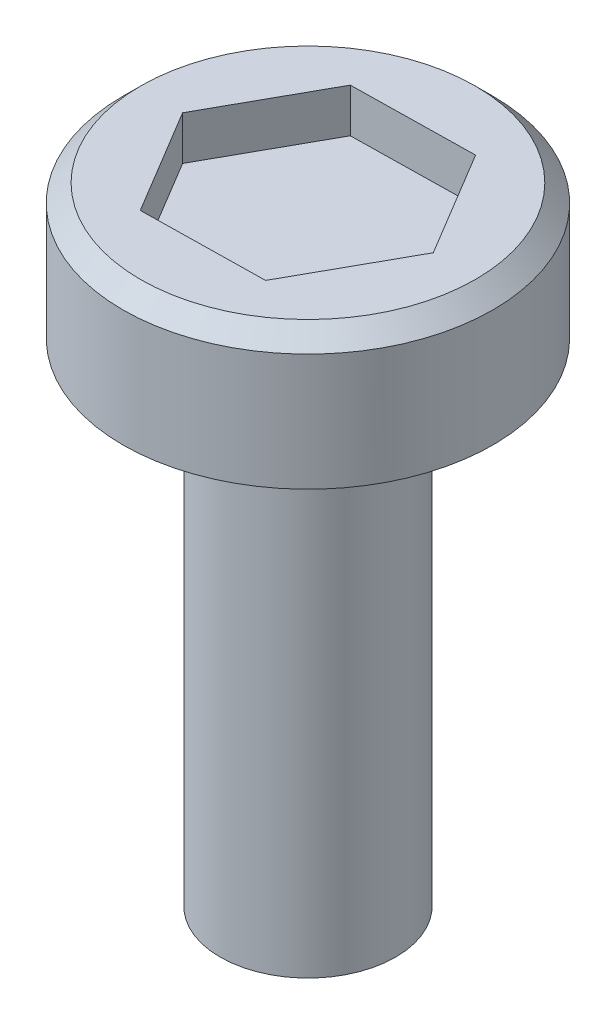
ISO-10303-21;
HEADER;
FILE_DESCRIPTION(('STEP AP214'),'2;1');
FILE_NAME('part.step','',(''),(''),'','','');
FILE_SCHEMA(('AUTOMOTIVE_DESIGN { 1 0 10303 214 1 1 1 1 }'));
ENDSEC;
DATA;
#1=APPLICATION_CONTEXT('core data for automotive mechanical design processes');
#2=APPLICATION_PROTOCOL_DEFINITION('international standard','automotive_design',2000,#1);
#3=PRODUCT_CONTEXT('',#1,'mechanical');
#4=PRODUCT('Part','Part','',(#3));
#5=PRODUCT_RELATED_PRODUCT_CATEGORY('part','',(#4));
#6=PRODUCT_DEFINITION_FORMATION('','',#4);
#7=PRODUCT_DEFINITION_CONTEXT('part definition',#1,'design');
#8=PRODUCT_DEFINITION('design','',#6,#7);
#9=PRODUCT_DEFINITION_SHAPE('','',#8);
#10=(LENGTH_UNIT() NAMED_UNIT(*) SI_UNIT(.MILLI.,.METRE.));
#11=(NAMED_UNIT(*) PLANE_ANGLE_UNIT() SI_UNIT($,.RADIAN.));
#12=(NAMED_UNIT(*) SI_UNIT($,.STERADIAN.) SOLID_ANGLE_UNIT());
#13=UNCERTAINTY_MEASURE_WITH_UNIT(LENGTH_MEASURE(1.E-05),#10,'distance_accuracy_value','');
#14=(GEOMETRIC_REPRESENTATION_CONTEXT(3) GLOBAL_UNCERTAINTY_ASSIGNED_CONTEXT((#13)) GLOBAL_UNIT_ASSIGNED_CONTEXT((#10,
#11,#12)) REPRESENTATION_CONTEXT('',''));
#15=CARTESIAN_POINT('',(0.,0.,0.));
#16=DIRECTION('',(0.,0.,1.));
#17=DIRECTION('',(1.,0.,0.));
#18=AXIS2_PLACEMENT_3D('',#15,#16,#17);
#19=CARTESIAN_POINT('',(0.,0.,0.));
#20=DIRECTION('',(0.,1.,0.));
#21=DIRECTION('',(0.,0.,1.));
#22=AXIS2_PLACEMENT_3D('',#19,#20,#21);
#23=PLANE('',#22);
#24=CARTESIAN_POINT('',(0.,0.,0.));
#25=DIRECTION('',(0.,1.,0.));
#26=DIRECTION('',(0.,0.,1.));
#27=AXIS2_PLACEMENT_3D('',#24,#25,#26);
#28=CIRCLE('',#27,10.);
#29=CARTESIAN_POINT('',(0.,0.,10.));
#30=VERTEX_POINT('',#29);
#31=EDGE_CURVE('E140',#30,#30,#28,.T.);
#32=ORIENTED_EDGE('',*,*,#31,.F.);
#33=EDGE_LOOP('',(#32));
#34=FACE_BOUND('',#33,.T.);
#35=ADVANCED_FACE('F26',(#34),#23,.F.);
#36=CARTESIAN_POINT('',(0.,71.3791625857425,0.));
#37=DIRECTION('',(0.,1.,0.));
#38=DIRECTION('',(0.,0.,1.));
#39=AXIS2_PLACEMENT_3D('',#36,#37,#38);
#40=CYLINDRICAL_SURFACE('',#39,10.);
#41=CARTESIAN_POINT('',(0.,56.0530849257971,0.));
#42=DIRECTION('',(0.,1.,0.));
#43=DIRECTION('',(0.,0.,1.));
#44=AXIS2_PLACEMENT_3D('',#41,#42,#43);
#45=CIRCLE('',#44,10.);
#46=CARTESIAN_POINT('',(0.,56.0530849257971,10.));
#47=VERTEX_POINT('',#46);
#48=EDGE_CURVE('E137',#47,#47,#45,.T.);
#49=ORIENTED_EDGE('',*,*,#48,.F.);
#50=EDGE_LOOP('',(#49));
#51=FACE_BOUND('',#50,.T.);
#52=ORIENTED_EDGE('',*,*,#31,.T.);
#53=EDGE_LOOP('',(#52));
#54=FACE_BOUND('',#53,.T.);
#55=ADVANCED_FACE('F161',(#51,#54),#40,.T.);
#56=CARTESIAN_POINT('',(10.,56.0530849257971,0.));
#57=DIRECTION('',(0.,1.,0.));
#58=DIRECTION('',(0.,0.,1.));
#59=AXIS2_PLACEMENT_3D('',#56,#57,#58);
#60=PLANE('',#59);
#61=CARTESIAN_POINT('',(0.,56.0530849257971,0.));
#62=DIRECTION('',(0.,1.,0.));
#63=DIRECTION('',(0.,0.,1.));
#64=AXIS2_PLACEMENT_3D('',#61,#62,#63);
#65=CIRCLE('',#64,21.0772142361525);
#66=CARTESIAN_POINT('',(0.,56.0530849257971,21.0772142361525));
#67=VERTEX_POINT('',#66);
#68=EDGE_CURVE('E128',#67,#67,#65,.T.);
#69=ORIENTED_EDGE('',*,*,#68,.F.);
#70=EDGE_LOOP('',(#69));
#71=FACE_BOUND('',#70,.T.);
#72=ORIENTED_EDGE('',*,*,#48,.T.);
#73=EDGE_LOOP('',(#72));
#74=FACE_BOUND('',#73,.T.);
#75=ADVANCED_FACE('F166',(#71,#74),#60,.F.);
#76=CARTESIAN_POINT('',(0.,71.3791625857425,0.));
#77=DIRECTION('',(0.,1.,0.));
#78=DIRECTION('',(0.,0.,1.));
#79=AXIS2_PLACEMENT_3D('',#76,#77,#78);
#80=CYLINDRICAL_SURFACE('',#79,21.0772142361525);
#81=CARTESIAN_POINT('',(0.,69.3791625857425,0.));
#82=DIRECTION('',(0.,-1.,0.));
#83=DIRECTION('',(0.,0.,-1.));
#84=AXIS2_PLACEMENT_3D('',#81,#82,#83);
#85=CIRCLE('',#84,21.0772142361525);
#86=CARTESIAN_POINT('',(0.,69.3791625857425,-21.0772142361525));
#87=VERTEX_POINT('',#86);
#88=EDGE_CURVE('E11',#87,#87,#85,.T.);
#89=ORIENTED_EDGE('',*,*,#88,.T.);
#90=EDGE_LOOP('',(#89));
#91=FACE_BOUND('',#90,.T.);
#92=ORIENTED_EDGE('',*,*,#68,.T.);
#93=EDGE_LOOP('',(#92));
#94=FACE_BOUND('',#93,.T.);
#95=ADVANCED_FACE('F157',(#91,#94),#80,.T.);
#96=CARTESIAN_POINT('',(21.0772142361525,71.3791625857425,0.));
#97=DIRECTION('',(0.,-1.,0.));
#98=DIRECTION('',(0.,0.,-1.));
#99=AXIS2_PLACEMENT_3D('',#96,#97,#98);
#100=PLANE('',#99);
#101=DIRECTION('',(-0.999862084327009,0.,0.0166075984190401));
#102=VECTOR('',#101,1.);
#103=CARTESIAN_POINT('',(6.81847273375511,71.3791625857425,-12.2763764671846));
#104=LINE('',#103,#102);
#105=CARTESIAN_POINT('',(6.81847273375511,71.3791625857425,-12.2763764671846));
#106=VERTEX_POINT('',#105);
#107=CARTESIAN_POINT('',(-7.22241752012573,71.3791625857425,-12.0431588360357));
#108=VERTEX_POINT('',#107);
#109=EDGE_CURVE('E94',#106,#108,#104,.T.);
#110=ORIENTED_EDGE('',*,*,#109,.F.);
#111=DIRECTION('',(-0.514313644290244,0.,-0.857602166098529));
#112=VECTOR('',#111,1.);
#113=CARTESIAN_POINT('',(14.0408902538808,71.3791625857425,-0.233217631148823));
#114=LINE('',#113,#112);
#115=CARTESIAN_POINT('',(14.0408902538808,71.3791625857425,-0.233217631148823));
#116=VERTEX_POINT('',#115);
#117=EDGE_CURVE('E40',#116,#106,#114,.T.);
#118=ORIENTED_EDGE('',*,*,#117,.F.);
#119=DIRECTION('',(0.485548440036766,0.,-0.874209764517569));
#120=VECTOR('',#119,1.);
#121=CARTESIAN_POINT('',(7.22241752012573,71.3791625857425,12.0431588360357));
#122=LINE('',#121,#120);
#123=CARTESIAN_POINT('',(7.22241752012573,71.3791625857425,12.0431588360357));
#124=VERTEX_POINT('',#123);
#125=EDGE_CURVE('E110',#124,#116,#122,.T.);
#126=ORIENTED_EDGE('',*,*,#125,.F.);
#127=DIRECTION('',(0.99986208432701,0.,-0.0166075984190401));
#128=VECTOR('',#127,1.);
#129=CARTESIAN_POINT('',(-6.81847273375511,71.3791625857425,12.2763764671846));
#130=LINE('',#129,#128);
#131=CARTESIAN_POINT('',(-6.81847273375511,71.3791625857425,12.2763764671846));
#132=VERTEX_POINT('',#131);
#133=EDGE_CURVE('E104',#132,#124,#130,.T.);
#134=ORIENTED_EDGE('',*,*,#133,.F.);
#135=DIRECTION('',(0.514313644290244,0.,0.857602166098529));
#136=VECTOR('',#135,1.);
#137=CARTESIAN_POINT('',(-14.0408902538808,71.3791625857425,0.233217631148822));
#138=LINE('',#137,#136);
#139=CARTESIAN_POINT('',(-14.0408902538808,71.3791625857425,0.233217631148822));
#140=VERTEX_POINT('',#139);
#141=EDGE_CURVE('E102',#140,#132,#138,.T.);
#142=ORIENTED_EDGE('',*,*,#141,.F.);
#143=DIRECTION('',(-0.485548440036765,0.,0.874209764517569));
#144=VECTOR('',#143,1.);
#145=CARTESIAN_POINT('',(-7.22241752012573,71.3791625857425,-12.0431588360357));
#146=LINE('',#145,#144);
#147=EDGE_CURVE('E83',#108,#140,#146,.T.);
#148=ORIENTED_EDGE('',*,*,#147,.F.);
#149=EDGE_LOOP('',(#110,#118,#126,#134,#142,#148));
#150=FACE_BOUND('',#149,.T.);
#151=CARTESIAN_POINT('',(0.,71.3791625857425,0.));
#152=DIRECTION('',(0.,-1.,0.));
#153=DIRECTION('',(0.,0.,-1.));
#154=AXIS2_PLACEMENT_3D('',#151,#152,#153);
#155=CIRCLE('',#154,19.0772142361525);
#156=CARTESIAN_POINT('',(0.,71.3791625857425,-19.0772142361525));
#157=VERTEX_POINT('',#156);
#158=EDGE_CURVE('E33',#157,#157,#155,.F.);
#159=ORIENTED_EDGE('',*,*,#158,.T.);
#160=EDGE_LOOP('',(#159));
#161=FACE_BOUND('',#160,.T.);
#162=ADVANCED_FACE('F98',(#150,#161),#100,.F.);
#163=CARTESIAN_POINT('',(0.,71.3791625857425,0.));
#164=DIRECTION('',(0.,-1.,0.));
#165=DIRECTION('',(0.,0.,-1.));
#166=AXIS2_PLACEMENT_3D('',#163,#164,#165);
#167=CONICAL_SURFACE('',#166,19.0772142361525,0.785398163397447);
#168=ORIENTED_EDGE('',*,*,#88,.F.);
#169=EDGE_LOOP('',(#168));
#170=FACE_BOUND('',#169,.T.);
#171=ORIENTED_EDGE('',*,*,#158,.F.);
#172=EDGE_LOOP('',(#171));
#173=FACE_BOUND('',#172,.T.);
#174=ADVANCED_FACE('F145',(#170,#173),#167,.T.);
#175=CARTESIAN_POINT('',(14.0408902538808,66.3791625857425,-0.233217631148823));
#176=DIRECTION('',(0.857602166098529,0.,-0.514313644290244));
#177=DIRECTION('',(-0.514313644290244,0.,-0.857602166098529));
#178=AXIS2_PLACEMENT_3D('',#175,#176,#177);
#179=PLANE('',#178);
#180=ORIENTED_EDGE('',*,*,#117,.T.);
#181=DIRECTION('',(0.,1.,0.));
#182=VECTOR('',#181,1.);
#183=CARTESIAN_POINT('',(6.81847273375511,66.3791625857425,-12.2763764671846));
#184=LINE('',#183,#182);
#185=CARTESIAN_POINT('',(6.81847273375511,66.3791625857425,-12.2763764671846));
#186=VERTEX_POINT('',#185);
#187=EDGE_CURVE('E91',#186,#106,#184,.T.);
#188=ORIENTED_EDGE('',*,*,#187,.F.);
#189=DIRECTION('',(-0.514313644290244,0.,-0.857602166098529));
#190=VECTOR('',#189,1.);
#191=CARTESIAN_POINT('',(14.0408902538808,66.3791625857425,-0.233217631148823));
#192=LINE('',#191,#190);
#193=CARTESIAN_POINT('',(14.0408902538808,66.3791625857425,-0.233217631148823));
#194=VERTEX_POINT('',#193);
#195=EDGE_CURVE('E112',#194,#186,#192,.T.);
#196=ORIENTED_EDGE('',*,*,#195,.F.);
#197=DIRECTION('',(0.,1.,0.));
#198=VECTOR('',#197,1.);
#199=CARTESIAN_POINT('',(14.0408902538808,66.3791625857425,-0.233217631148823));
#200=LINE('',#199,#198);
#201=EDGE_CURVE('E47',#194,#116,#200,.T.);
#202=ORIENTED_EDGE('',*,*,#201,.T.);
#203=EDGE_LOOP('',(#180,#188,#196,#202));
#204=FACE_BOUND('',#203,.T.);
#205=ADVANCED_FACE('F147',(#204),#179,.F.);
#206=CARTESIAN_POINT('',(7.22241752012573,66.3791625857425,12.0431588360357));
#207=DIRECTION('',(0.874209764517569,0.,0.485548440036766));
#208=DIRECTION('',(0.485548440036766,0.,-0.874209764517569));
#209=AXIS2_PLACEMENT_3D('',#206,#207,#208);
#210=PLANE('',#209);
#211=ORIENTED_EDGE('',*,*,#125,.T.);
#212=ORIENTED_EDGE('',*,*,#201,.F.);
#213=DIRECTION('',(0.485548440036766,0.,-0.874209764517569));
#214=VECTOR('',#213,1.);
#215=CARTESIAN_POINT('',(7.22241752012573,66.3791625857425,12.0431588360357));
#216=LINE('',#215,#214);
#217=CARTESIAN_POINT('',(7.22241752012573,66.3791625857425,12.0431588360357));
#218=VERTEX_POINT('',#217);
#219=EDGE_CURVE('E124',#218,#194,#216,.T.);
#220=ORIENTED_EDGE('',*,*,#219,.F.);
#221=DIRECTION('',(0.,1.,0.));
#222=VECTOR('',#221,1.);
#223=CARTESIAN_POINT('',(7.22241752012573,66.3791625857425,12.0431588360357));
#224=LINE('',#223,#222);
#225=EDGE_CURVE('E129',#218,#124,#224,.T.);
#226=ORIENTED_EDGE('',*,*,#225,.T.);
#227=EDGE_LOOP('',(#211,#212,#220,#226));
#228=FACE_BOUND('',#227,.T.);
#229=ADVANCED_FACE('F155',(#228),#210,.F.);
#230=CARTESIAN_POINT('',(-6.81847273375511,66.3791625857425,12.2763764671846));
#231=DIRECTION('',(0.0166075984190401,0.,0.99986208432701));
#232=DIRECTION('',(0.99986208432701,0.,-0.0166075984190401));
#233=AXIS2_PLACEMENT_3D('',#230,#231,#232);
#234=PLANE('',#233);
#235=ORIENTED_EDGE('',*,*,#133,.T.);
#236=ORIENTED_EDGE('',*,*,#225,.F.);
#237=DIRECTION('',(0.99986208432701,0.,-0.0166075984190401));
#238=VECTOR('',#237,1.);
#239=CARTESIAN_POINT('',(-6.81847273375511,66.3791625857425,12.2763764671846));
#240=LINE('',#239,#238);
#241=CARTESIAN_POINT('',(-6.81847273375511,66.3791625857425,12.2763764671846));
#242=VERTEX_POINT('',#241);
#243=EDGE_CURVE('E121',#242,#218,#240,.T.);
#244=ORIENTED_EDGE('',*,*,#243,.F.);
#245=DIRECTION('',(0.,1.,0.));
#246=VECTOR('',#245,1.);
#247=CARTESIAN_POINT('',(-6.81847273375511,66.3791625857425,12.2763764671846));
#248=LINE('',#247,#246);
#249=EDGE_CURVE('E131',#242,#132,#248,.T.);
#250=ORIENTED_EDGE('',*,*,#249,.T.);
#251=EDGE_LOOP('',(#235,#236,#244,#250));
#252=FACE_BOUND('',#251,.T.);
#253=ADVANCED_FACE('F208',(#252),#234,.F.);
#254=CARTESIAN_POINT('',(-14.0408902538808,66.3791625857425,0.233217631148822));
#255=DIRECTION('',(-0.857602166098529,0.,0.514313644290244));
#256=DIRECTION('',(0.514313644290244,0.,0.857602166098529));
#257=AXIS2_PLACEMENT_3D('',#254,#255,#256);
#258=PLANE('',#257);
#259=ORIENTED_EDGE('',*,*,#141,.T.);
#260=ORIENTED_EDGE('',*,*,#249,.F.);
#261=DIRECTION('',(0.514313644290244,0.,0.857602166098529));
#262=VECTOR('',#261,1.);
#263=CARTESIAN_POINT('',(-14.0408902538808,66.3791625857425,0.233217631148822));
#264=LINE('',#263,#262);
#265=CARTESIAN_POINT('',(-14.0408902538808,66.3791625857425,0.233217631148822));
#266=VERTEX_POINT('',#265);
#267=EDGE_CURVE('E118',#266,#242,#264,.T.);
#268=ORIENTED_EDGE('',*,*,#267,.F.);
#269=DIRECTION('',(0.,1.,0.));
#270=VECTOR('',#269,1.);
#271=CARTESIAN_POINT('',(-14.0408902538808,66.3791625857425,0.233217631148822));
#272=LINE('',#271,#270);
#273=EDGE_CURVE('E90',#266,#140,#272,.T.);
#274=ORIENTED_EDGE('',*,*,#273,.T.);
#275=EDGE_LOOP('',(#259,#260,#268,#274));
#276=FACE_BOUND('',#275,.T.);
#277=ADVANCED_FACE('F215',(#276),#258,.F.);
#278=CARTESIAN_POINT('',(-7.22241752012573,66.3791625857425,-12.0431588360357));
#279=DIRECTION('',(-0.874209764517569,0.,-0.485548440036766));
#280=DIRECTION('',(-0.485548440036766,0.,0.874209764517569));
#281=AXIS2_PLACEMENT_3D('',#278,#279,#280);
#282=PLANE('',#281);
#283=ORIENTED_EDGE('',*,*,#147,.T.);
#284=ORIENTED_EDGE('',*,*,#273,.F.);
#285=DIRECTION('',(-0.485548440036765,0.,0.874209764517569));
#286=VECTOR('',#285,1.);
#287=CARTESIAN_POINT('',(-7.22241752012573,66.3791625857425,-12.0431588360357));
#288=LINE('',#287,#286);
#289=CARTESIAN_POINT('',(-7.22241752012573,66.3791625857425,-12.0431588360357));
#290=VERTEX_POINT('',#289);
#291=EDGE_CURVE('E86',#290,#266,#288,.T.);
#292=ORIENTED_EDGE('',*,*,#291,.F.);
#293=DIRECTION('',(0.,1.,0.));
#294=VECTOR('',#293,1.);
#295=CARTESIAN_POINT('',(-7.22241752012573,66.3791625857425,-12.0431588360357));
#296=LINE('',#295,#294);
#297=EDGE_CURVE('E79',#290,#108,#296,.T.);
#298=ORIENTED_EDGE('',*,*,#297,.T.);
#299=EDGE_LOOP('',(#283,#284,#292,#298));
#300=FACE_BOUND('',#299,.T.);
#301=ADVANCED_FACE('F81',(#300),#282,.F.);
#302=CARTESIAN_POINT('',(6.81847273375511,66.3791625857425,-12.2763764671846));
#303=DIRECTION('',(-0.0166075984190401,0.,-0.99986208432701));
#304=DIRECTION('',(-0.99986208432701,0.,0.0166075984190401));
#305=AXIS2_PLACEMENT_3D('',#302,#303,#304);
#306=PLANE('',#305);
#307=ORIENTED_EDGE('',*,*,#109,.T.);
#308=ORIENTED_EDGE('',*,*,#297,.F.);
#309=DIRECTION('',(-0.999862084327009,0.,0.0166075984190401));
#310=VECTOR('',#309,1.);
#311=CARTESIAN_POINT('',(6.81847273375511,66.3791625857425,-12.2763764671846));
#312=LINE('',#311,#310);
#313=EDGE_CURVE('E115',#186,#290,#312,.T.);
#314=ORIENTED_EDGE('',*,*,#313,.F.);
#315=ORIENTED_EDGE('',*,*,#187,.T.);
#316=EDGE_LOOP('',(#307,#308,#314,#315));
#317=FACE_BOUND('',#316,.T.);
#318=ADVANCED_FACE('F95',(#317),#306,.F.);
#319=CARTESIAN_POINT('',(6.81847273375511,66.3791625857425,-12.2763764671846));
#320=DIRECTION('',(0.,1.,0.));
#321=DIRECTION('',(0.,0.,1.));
#322=AXIS2_PLACEMENT_3D('',#319,#320,#321);
#323=PLANE('',#322);
#324=ORIENTED_EDGE('',*,*,#195,.T.);
#325=ORIENTED_EDGE('',*,*,#313,.T.);
#326=ORIENTED_EDGE('',*,*,#291,.T.);
#327=ORIENTED_EDGE('',*,*,#267,.T.);
#328=ORIENTED_EDGE('',*,*,#243,.T.);
#329=ORIENTED_EDGE('',*,*,#219,.T.);
#330=EDGE_LOOP('',(#324,#325,#326,#327,#328,#329));
#331=FACE_BOUND('',#330,.T.);
#332=ADVANCED_FACE('F236',(#331),#323,.T.);
#333=CLOSED_SHELL('',(#35,#55,#75,#95,#162,#174,#205,#229,#253,#277,#301,#318,#332));
#334=MANIFOLD_SOLID_BREP('B2',#333);
#335=ADVANCED_BREP_SHAPE_REPRESENTATION('',(#18,#334),#14);
#336=SHAPE_DEFINITION_REPRESENTATION(#9,#335);
ENDSEC;
END-ISO-10303-21;
